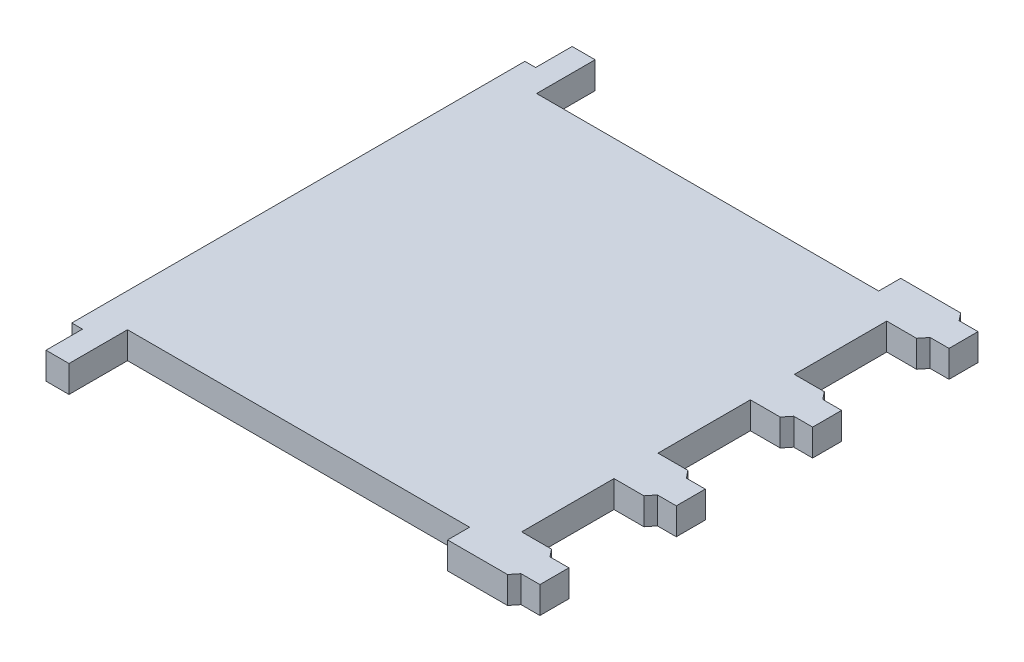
ISO-10303-21;
HEADER;
FILE_DESCRIPTION(('STEP AP214'),'2;1');
FILE_NAME('part.step','',(''),(''),'','','');
FILE_SCHEMA(('AUTOMOTIVE_DESIGN { 1 0 10303 214 1 1 1 1 }'));
ENDSEC;
DATA;
#1=APPLICATION_CONTEXT('core data for automotive mechanical design processes');
#2=APPLICATION_PROTOCOL_DEFINITION('international standard','automotive_design',2000,#1);
#3=PRODUCT_CONTEXT('',#1,'mechanical');
#4=PRODUCT('Part','Part','',(#3));
#5=PRODUCT_RELATED_PRODUCT_CATEGORY('part','',(#4));
#6=PRODUCT_DEFINITION_FORMATION('','',#4);
#7=PRODUCT_DEFINITION_CONTEXT('part definition',#1,'design');
#8=PRODUCT_DEFINITION('design','',#6,#7);
#9=PRODUCT_DEFINITION_SHAPE('','',#8);
#10=(LENGTH_UNIT() NAMED_UNIT(*) SI_UNIT(.MILLI.,.METRE.));
#11=(NAMED_UNIT(*) PLANE_ANGLE_UNIT() SI_UNIT($,.RADIAN.));
#12=(NAMED_UNIT(*) SI_UNIT($,.STERADIAN.) SOLID_ANGLE_UNIT());
#13=UNCERTAINTY_MEASURE_WITH_UNIT(LENGTH_MEASURE(1.E-05),#10,'distance_accuracy_value','');
#14=(GEOMETRIC_REPRESENTATION_CONTEXT(3) GLOBAL_UNCERTAINTY_ASSIGNED_CONTEXT((#13)) GLOBAL_UNIT_ASSIGNED_CONTEXT((#10,
#11,#12)) REPRESENTATION_CONTEXT('',''));
#15=CARTESIAN_POINT('',(0.,0.,0.));
#16=DIRECTION('',(0.,0.,1.));
#17=DIRECTION('',(1.,0.,0.));
#18=AXIS2_PLACEMENT_3D('',#15,#16,#17);
#19=CARTESIAN_POINT('',(3.13,0.,-1.77));
#20=DIRECTION('',(1.,0.,0.));
#21=DIRECTION('',(0.,0.,-1.));
#22=AXIS2_PLACEMENT_3D('',#19,#20,#21);
#23=PLANE('',#22);
#24=DIRECTION('',(0.,1.,0.));
#25=VECTOR('',#24,1.);
#26=CARTESIAN_POINT('',(3.13,0.,-2.04));
#27=LINE('',#26,#25);
#28=CARTESIAN_POINT('',(3.13,0.,-2.04));
#29=VERTEX_POINT('',#28);
#30=CARTESIAN_POINT('',(3.13,0.25,-2.04));
#31=VERTEX_POINT('',#30);
#32=EDGE_CURVE('E11',#29,#31,#27,.T.);
#33=ORIENTED_EDGE('',*,*,#32,.T.);
#34=DIRECTION('',(0.,0.,-1.));
#35=VECTOR('',#34,1.);
#36=CARTESIAN_POINT('',(3.13,0.25,-1.77));
#37=LINE('',#36,#35);
#38=CARTESIAN_POINT('',(3.13,0.25,-1.77));
#39=VERTEX_POINT('',#38);
#40=EDGE_CURVE('E25',#39,#31,#37,.T.);
#41=ORIENTED_EDGE('',*,*,#40,.F.);
#42=DIRECTION('',(0.,1.,0.));
#43=VECTOR('',#42,1.);
#44=CARTESIAN_POINT('',(3.13,0.,-1.77));
#45=LINE('',#44,#43);
#46=CARTESIAN_POINT('',(3.13,0.,-1.77));
#47=VERTEX_POINT('',#46);
#48=EDGE_CURVE('E315',#47,#39,#45,.T.);
#49=ORIENTED_EDGE('',*,*,#48,.F.);
#50=DIRECTION('',(0.,0.,-1.));
#51=VECTOR('',#50,1.);
#52=CARTESIAN_POINT('',(3.13,0.,-1.77));
#53=LINE('',#52,#51);
#54=EDGE_CURVE('E774',#47,#29,#53,.T.);
#55=ORIENTED_EDGE('',*,*,#54,.T.);
#56=EDGE_LOOP('',(#33,#41,#49,#55));
#57=FACE_BOUND('',#56,.T.);
#58=ADVANCED_FACE('F17',(#57),#23,.T.);
#59=CARTESIAN_POINT('',(0.,0.,0.));
#60=DIRECTION('',(0.,1.,0.));
#61=DIRECTION('',(1.,0.,0.));
#62=AXIS2_PLACEMENT_3D('',#59,#60,#61);
#63=PLANE('',#62);
#64=DIRECTION('',(0.,0.,1.));
#65=VECTOR('',#64,1.);
#66=CARTESIAN_POINT('',(-1.06,0.,2.11));
#67=LINE('',#66,#65);
#68=CARTESIAN_POINT('',(-1.06,0.,2.11));
#69=VERTEX_POINT('',#68);
#70=CARTESIAN_POINT('',(-1.06,0.,2.45));
#71=VERTEX_POINT('',#70);
#72=EDGE_CURVE('E769',#69,#71,#67,.T.);
#73=ORIENTED_EDGE('',*,*,#72,.F.);
#74=DIRECTION('',(1.,0.,0.));
#75=VECTOR('',#74,1.);
#76=CARTESIAN_POINT('',(-1.16,0.,2.11));
#77=LINE('',#76,#75);
#78=CARTESIAN_POINT('',(-1.16,0.,2.11));
#79=VERTEX_POINT('',#78);
#80=EDGE_CURVE('E764',#79,#69,#77,.T.);
#81=ORIENTED_EDGE('',*,*,#80,.F.);
#82=DIRECTION('',(0.,0.,1.));
#83=VECTOR('',#82,1.);
#84=CARTESIAN_POINT('',(-1.16,0.,-2.11));
#85=LINE('',#84,#83);
#86=CARTESIAN_POINT('',(-1.16,0.,-2.11));
#87=VERTEX_POINT('',#86);
#88=EDGE_CURVE('E759',#87,#79,#85,.T.);
#89=ORIENTED_EDGE('',*,*,#88,.F.);
#90=DIRECTION('',(-1.,0.,0.));
#91=VECTOR('',#90,1.);
#92=CARTESIAN_POINT('',(-1.06,0.,-2.11));
#93=LINE('',#92,#91);
#94=CARTESIAN_POINT('',(-1.06,0.,-2.11));
#95=VERTEX_POINT('',#94);
#96=EDGE_CURVE('E754',#95,#87,#93,.T.);
#97=ORIENTED_EDGE('',*,*,#96,.F.);
#98=DIRECTION('',(0.,0.,1.));
#99=VECTOR('',#98,1.);
#100=CARTESIAN_POINT('',(-1.06,0.,-2.45));
#101=LINE('',#100,#99);
#102=CARTESIAN_POINT('',(-1.06,0.,-2.45));
#103=VERTEX_POINT('',#102);
#104=EDGE_CURVE('E749',#103,#95,#101,.T.);
#105=ORIENTED_EDGE('',*,*,#104,.F.);
#106=DIRECTION('',(-1.,0.,0.));
#107=VECTOR('',#106,1.);
#108=CARTESIAN_POINT('',(-0.845758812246,0.,-2.45));
#109=LINE('',#108,#107);
#110=CARTESIAN_POINT('',(-0.845758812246,0.,-2.45));
#111=VERTEX_POINT('',#110);
#112=EDGE_CURVE('E744',#111,#103,#109,.T.);
#113=ORIENTED_EDGE('',*,*,#112,.F.);
#114=DIRECTION('',(0.,0.,-1.));
#115=VECTOR('',#114,1.);
#116=CARTESIAN_POINT('',(-0.845758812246,0.,-1.905));
#117=LINE('',#116,#115);
#118=CARTESIAN_POINT('',(-0.845758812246,0.,-1.905));
#119=VERTEX_POINT('',#118);
#120=EDGE_CURVE('E739',#119,#111,#117,.T.);
#121=ORIENTED_EDGE('',*,*,#120,.F.);
#122=DIRECTION('',(-1.,0.,0.));
#123=VECTOR('',#122,1.);
#124=CARTESIAN_POINT('',(2.34,0.,-1.905));
#125=LINE('',#124,#123);
#126=CARTESIAN_POINT('',(2.34,0.,-1.905));
#127=VERTEX_POINT('',#126);
#128=EDGE_CURVE('E734',#127,#119,#125,.T.);
#129=ORIENTED_EDGE('',*,*,#128,.F.);
#130=DIRECTION('',(0.,0.,1.));
#131=VECTOR('',#130,1.);
#132=CARTESIAN_POINT('',(2.34,0.,-2.11));
#133=LINE('',#132,#131);
#134=CARTESIAN_POINT('',(2.34,0.,-2.11));
#135=VERTEX_POINT('',#134);
#136=EDGE_CURVE('E729',#135,#127,#133,.T.);
#137=ORIENTED_EDGE('',*,*,#136,.F.);
#138=DIRECTION('',(-1.,0.,0.));
#139=VECTOR('',#138,1.);
#140=CARTESIAN_POINT('',(2.89809535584,0.,-2.11));
#141=LINE('',#140,#139);
#142=CARTESIAN_POINT('',(2.89809535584,0.,-2.11));
#143=VERTEX_POINT('',#142);
#144=EDGE_CURVE('E724',#143,#135,#141,.T.);
#145=ORIENTED_EDGE('',*,*,#144,.F.);
#146=DIRECTION('',(-0.625007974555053,0.,-0.780618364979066));
#147=VECTOR('',#146,1.);
#148=CARTESIAN_POINT('',(2.954141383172,0.,-2.04));
#149=LINE('',#148,#147);
#150=CARTESIAN_POINT('',(2.954141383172,0.,-2.04));
#151=VERTEX_POINT('',#150);
#152=EDGE_CURVE('E719',#151,#143,#149,.T.);
#153=ORIENTED_EDGE('',*,*,#152,.F.);
#154=DIRECTION('',(-1.,0.,0.));
#155=VECTOR('',#154,1.);
#156=CARTESIAN_POINT('',(3.13,0.,-2.04));
#157=LINE('',#156,#155);
#158=EDGE_CURVE('E714',#29,#151,#157,.T.);
#159=ORIENTED_EDGE('',*,*,#158,.F.);
#160=ORIENTED_EDGE('',*,*,#54,.F.);
#161=DIRECTION('',(1.,0.,0.));
#162=VECTOR('',#161,1.);
#163=CARTESIAN_POINT('',(2.954141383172,0.,-1.77));
#164=LINE('',#163,#162);
#165=CARTESIAN_POINT('',(2.954141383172,0.,-1.77));
#166=VERTEX_POINT('',#165);
#167=EDGE_CURVE('E710',#166,#47,#164,.T.);
#168=ORIENTED_EDGE('',*,*,#167,.F.);
#169=DIRECTION('',(0.625007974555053,0.,-0.780618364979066));
#170=VECTOR('',#169,1.);
#171=CARTESIAN_POINT('',(2.89809535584,0.,-1.7));
#172=LINE('',#171,#170);
#173=CARTESIAN_POINT('',(2.89809535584,0.,-1.7));
#174=VERTEX_POINT('',#173);
#175=EDGE_CURVE('E309',#174,#166,#172,.T.);
#176=ORIENTED_EDGE('',*,*,#175,.F.);
#177=DIRECTION('',(1.,0.,0.));
#178=VECTOR('',#177,1.);
#179=CARTESIAN_POINT('',(2.62,0.,-1.7));
#180=LINE('',#179,#178);
#181=CARTESIAN_POINT('',(2.62,0.,-1.7));
#182=VERTEX_POINT('',#181);
#183=EDGE_CURVE('E702',#182,#174,#180,.T.);
#184=ORIENTED_EDGE('',*,*,#183,.F.);
#185=DIRECTION('',(0.,0.,-1.));
#186=VECTOR('',#185,1.);
#187=CARTESIAN_POINT('',(2.62,0.,-0.84));
#188=LINE('',#187,#186);
#189=CARTESIAN_POINT('',(2.62,0.,-0.84));
#190=VERTEX_POINT('',#189);
#191=EDGE_CURVE('E697',#190,#182,#188,.T.);
#192=ORIENTED_EDGE('',*,*,#191,.F.);
#193=DIRECTION('',(-1.,0.,0.));
#194=VECTOR('',#193,1.);
#195=CARTESIAN_POINT('',(2.89809535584,0.,-0.84));
#196=LINE('',#195,#194);
#197=CARTESIAN_POINT('',(2.89809535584,0.,-0.84));
#198=VERTEX_POINT('',#197);
#199=EDGE_CURVE('E692',#198,#190,#196,.T.);
#200=ORIENTED_EDGE('',*,*,#199,.F.);
#201=DIRECTION('',(-0.625007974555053,0.,-0.780618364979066));
#202=VECTOR('',#201,1.);
#203=CARTESIAN_POINT('',(2.954141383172,0.,-0.77));
#204=LINE('',#203,#202);
#205=CARTESIAN_POINT('',(2.954141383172,0.,-0.77));
#206=VERTEX_POINT('',#205);
#207=EDGE_CURVE('E687',#206,#198,#204,.T.);
#208=ORIENTED_EDGE('',*,*,#207,.F.);
#209=DIRECTION('',(-1.,0.,0.));
#210=VECTOR('',#209,1.);
#211=CARTESIAN_POINT('',(3.13,0.,-0.77));
#212=LINE('',#211,#210);
#213=CARTESIAN_POINT('',(3.13,0.,-0.77));
#214=VERTEX_POINT('',#213);
#215=EDGE_CURVE('E682',#214,#206,#212,.T.);
#216=ORIENTED_EDGE('',*,*,#215,.F.);
#217=DIRECTION('',(0.,0.,-1.));
#218=VECTOR('',#217,1.);
#219=CARTESIAN_POINT('',(3.13,0.,-0.5));
#220=LINE('',#219,#218);
#221=CARTESIAN_POINT('',(3.13,0.,-0.5));
#222=VERTEX_POINT('',#221);
#223=EDGE_CURVE('E677',#222,#214,#220,.T.);
#224=ORIENTED_EDGE('',*,*,#223,.F.);
#225=DIRECTION('',(1.,0.,0.));
#226=VECTOR('',#225,1.);
#227=CARTESIAN_POINT('',(2.954141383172,0.,-0.5));
#228=LINE('',#227,#226);
#229=CARTESIAN_POINT('',(2.954141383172,0.,-0.5));
#230=VERTEX_POINT('',#229);
#231=EDGE_CURVE('E672',#230,#222,#228,.T.);
#232=ORIENTED_EDGE('',*,*,#231,.F.);
#233=DIRECTION('',(0.625007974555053,0.,-0.780618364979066));
#234=VECTOR('',#233,1.);
#235=CARTESIAN_POINT('',(2.89809535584,0.,-0.43));
#236=LINE('',#235,#234);
#237=CARTESIAN_POINT('',(2.89809535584,0.,-0.43));
#238=VERTEX_POINT('',#237);
#239=EDGE_CURVE('E667',#238,#230,#236,.T.);
#240=ORIENTED_EDGE('',*,*,#239,.F.);
#241=DIRECTION('',(1.,0.,0.));
#242=VECTOR('',#241,1.);
#243=CARTESIAN_POINT('',(2.62,0.,-0.43));
#244=LINE('',#243,#242);
#245=CARTESIAN_POINT('',(2.62,0.,-0.43));
#246=VERTEX_POINT('',#245);
#247=EDGE_CURVE('E662',#246,#238,#244,.T.);
#248=ORIENTED_EDGE('',*,*,#247,.F.);
#249=DIRECTION('',(0.,0.,-1.));
#250=VECTOR('',#249,1.);
#251=CARTESIAN_POINT('',(2.62,0.,0.43));
#252=LINE('',#251,#250);
#253=CARTESIAN_POINT('',(2.62,0.,0.43));
#254=VERTEX_POINT('',#253);
#255=EDGE_CURVE('E657',#254,#246,#252,.T.);
#256=ORIENTED_EDGE('',*,*,#255,.F.);
#257=DIRECTION('',(-1.,0.,0.));
#258=VECTOR('',#257,1.);
#259=CARTESIAN_POINT('',(2.89809535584,0.,0.43));
#260=LINE('',#259,#258);
#261=CARTESIAN_POINT('',(2.89809535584,0.,0.43));
#262=VERTEX_POINT('',#261);
#263=EDGE_CURVE('E652',#262,#254,#260,.T.);
#264=ORIENTED_EDGE('',*,*,#263,.F.);
#265=DIRECTION('',(-0.625007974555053,0.,-0.780618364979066));
#266=VECTOR('',#265,1.);
#267=CARTESIAN_POINT('',(2.954141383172,0.,0.5));
#268=LINE('',#267,#266);
#269=CARTESIAN_POINT('',(2.954141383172,0.,0.5));
#270=VERTEX_POINT('',#269);
#271=EDGE_CURVE('E647',#270,#262,#268,.T.);
#272=ORIENTED_EDGE('',*,*,#271,.F.);
#273=DIRECTION('',(-1.,0.,0.));
#274=VECTOR('',#273,1.);
#275=CARTESIAN_POINT('',(3.13,0.,0.5));
#276=LINE('',#275,#274);
#277=CARTESIAN_POINT('',(3.13,0.,0.5));
#278=VERTEX_POINT('',#277);
#279=EDGE_CURVE('E642',#278,#270,#276,.T.);
#280=ORIENTED_EDGE('',*,*,#279,.F.);
#281=DIRECTION('',(0.,0.,-1.));
#282=VECTOR('',#281,1.);
#283=CARTESIAN_POINT('',(3.13,0.,0.77));
#284=LINE('',#283,#282);
#285=CARTESIAN_POINT('',(3.13,0.,0.77));
#286=VERTEX_POINT('',#285);
#287=EDGE_CURVE('E637',#286,#278,#284,.T.);
#288=ORIENTED_EDGE('',*,*,#287,.F.);
#289=DIRECTION('',(1.,0.,0.));
#290=VECTOR('',#289,1.);
#291=CARTESIAN_POINT('',(2.954141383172,0.,0.77));
#292=LINE('',#291,#290);
#293=CARTESIAN_POINT('',(2.954141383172,0.,0.77));
#294=VERTEX_POINT('',#293);
#295=EDGE_CURVE('E632',#294,#286,#292,.T.);
#296=ORIENTED_EDGE('',*,*,#295,.F.);
#297=DIRECTION('',(0.625007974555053,0.,-0.780618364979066));
#298=VECTOR('',#297,1.);
#299=CARTESIAN_POINT('',(2.89809535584,0.,0.84));
#300=LINE('',#299,#298);
#301=CARTESIAN_POINT('',(2.89809535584,0.,0.84));
#302=VERTEX_POINT('',#301);
#303=EDGE_CURVE('E627',#302,#294,#300,.T.);
#304=ORIENTED_EDGE('',*,*,#303,.F.);
#305=DIRECTION('',(1.,0.,0.));
#306=VECTOR('',#305,1.);
#307=CARTESIAN_POINT('',(2.62,0.,0.84));
#308=LINE('',#307,#306);
#309=CARTESIAN_POINT('',(2.62,0.,0.84));
#310=VERTEX_POINT('',#309);
#311=EDGE_CURVE('E622',#310,#302,#308,.T.);
#312=ORIENTED_EDGE('',*,*,#311,.F.);
#313=DIRECTION('',(0.,0.,-1.));
#314=VECTOR('',#313,1.);
#315=CARTESIAN_POINT('',(2.62,0.,1.7));
#316=LINE('',#315,#314);
#317=CARTESIAN_POINT('',(2.62,0.,1.7));
#318=VERTEX_POINT('',#317);
#319=EDGE_CURVE('E617',#318,#310,#316,.T.);
#320=ORIENTED_EDGE('',*,*,#319,.F.);
#321=DIRECTION('',(-1.,0.,0.));
#322=VECTOR('',#321,1.);
#323=CARTESIAN_POINT('',(2.89809535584,0.,1.7));
#324=LINE('',#323,#322);
#325=CARTESIAN_POINT('',(2.89809535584,0.,1.7));
#326=VERTEX_POINT('',#325);
#327=EDGE_CURVE('E612',#326,#318,#324,.T.);
#328=ORIENTED_EDGE('',*,*,#327,.F.);
#329=DIRECTION('',(-0.625007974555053,0.,-0.780618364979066));
#330=VECTOR('',#329,1.);
#331=CARTESIAN_POINT('',(2.954141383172,0.,1.77));
#332=LINE('',#331,#330);
#333=CARTESIAN_POINT('',(2.954141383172,0.,1.77));
#334=VERTEX_POINT('',#333);
#335=EDGE_CURVE('E607',#334,#326,#332,.T.);
#336=ORIENTED_EDGE('',*,*,#335,.F.);
#337=DIRECTION('',(-1.,0.,0.));
#338=VECTOR('',#337,1.);
#339=CARTESIAN_POINT('',(3.13,0.,1.77));
#340=LINE('',#339,#338);
#341=CARTESIAN_POINT('',(3.13,0.,1.77));
#342=VERTEX_POINT('',#341);
#343=EDGE_CURVE('E602',#342,#334,#340,.T.);
#344=ORIENTED_EDGE('',*,*,#343,.F.);
#345=DIRECTION('',(0.,0.,-1.));
#346=VECTOR('',#345,1.);
#347=CARTESIAN_POINT('',(3.13,0.,2.04));
#348=LINE('',#347,#346);
#349=CARTESIAN_POINT('',(3.13,0.,2.04));
#350=VERTEX_POINT('',#349);
#351=EDGE_CURVE('E597',#350,#342,#348,.T.);
#352=ORIENTED_EDGE('',*,*,#351,.F.);
#353=DIRECTION('',(1.,0.,0.));
#354=VECTOR('',#353,1.);
#355=CARTESIAN_POINT('',(2.954141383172,0.,2.04));
#356=LINE('',#355,#354);
#357=CARTESIAN_POINT('',(2.954141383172,0.,2.04));
#358=VERTEX_POINT('',#357);
#359=EDGE_CURVE('E592',#358,#350,#356,.T.);
#360=ORIENTED_EDGE('',*,*,#359,.F.);
#361=DIRECTION('',(0.625007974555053,0.,-0.780618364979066));
#362=VECTOR('',#361,1.);
#363=CARTESIAN_POINT('',(2.89809535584,0.,2.11));
#364=LINE('',#363,#362);
#365=CARTESIAN_POINT('',(2.89809535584,0.,2.11));
#366=VERTEX_POINT('',#365);
#367=EDGE_CURVE('E587',#366,#358,#364,.T.);
#368=ORIENTED_EDGE('',*,*,#367,.F.);
#369=DIRECTION('',(1.,0.,0.));
#370=VECTOR('',#369,1.);
#371=CARTESIAN_POINT('',(2.34,0.,2.11));
#372=LINE('',#371,#370);
#373=CARTESIAN_POINT('',(2.34,0.,2.11));
#374=VERTEX_POINT('',#373);
#375=EDGE_CURVE('E582',#374,#366,#372,.T.);
#376=ORIENTED_EDGE('',*,*,#375,.F.);
#377=DIRECTION('',(0.,0.,1.));
#378=VECTOR('',#377,1.);
#379=CARTESIAN_POINT('',(2.34,0.,1.905));
#380=LINE('',#379,#378);
#381=CARTESIAN_POINT('',(2.34,0.,1.905));
#382=VERTEX_POINT('',#381);
#383=EDGE_CURVE('E577',#382,#374,#380,.T.);
#384=ORIENTED_EDGE('',*,*,#383,.F.);
#385=DIRECTION('',(1.,0.,0.));
#386=VECTOR('',#385,1.);
#387=CARTESIAN_POINT('',(-0.845758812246,0.,1.905));
#388=LINE('',#387,#386);
#389=CARTESIAN_POINT('',(-0.845758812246,0.,1.905));
#390=VERTEX_POINT('',#389);
#391=EDGE_CURVE('E572',#390,#382,#388,.T.);
#392=ORIENTED_EDGE('',*,*,#391,.F.);
#393=DIRECTION('',(0.,0.,-1.));
#394=VECTOR('',#393,1.);
#395=CARTESIAN_POINT('',(-0.845758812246,0.,2.45));
#396=LINE('',#395,#394);
#397=CARTESIAN_POINT('',(-0.845758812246,0.,2.45));
#398=VERTEX_POINT('',#397);
#399=EDGE_CURVE('E567',#398,#390,#396,.T.);
#400=ORIENTED_EDGE('',*,*,#399,.F.);
#401=DIRECTION('',(1.,0.,0.));
#402=VECTOR('',#401,1.);
#403=CARTESIAN_POINT('',(-1.06,0.,2.45));
#404=LINE('',#403,#402);
#405=EDGE_CURVE('E562',#71,#398,#404,.T.);
#406=ORIENTED_EDGE('',*,*,#405,.F.);
#407=EDGE_LOOP('',(#73,#81,#89,#97,#105,#113,#121,#129,#137,#145,#153,#159,#160,#168,#176,#184,
#192,#200,#208,#216,#224,#232,#240,#248,#256,#264,#272,#280,#288,#296,#304,#312,#320,#328,#336,
#344,#352,#360,#368,#376,#384,#392,#400,#406));
#408=FACE_BOUND('',#407,.T.);
#409=ADVANCED_FACE('F973',(#408),#63,.F.);
#410=CARTESIAN_POINT('',(-1.06,0.,2.45));
#411=DIRECTION('',(0.,0.,1.));
#412=DIRECTION('',(1.,0.,0.));
#413=AXIS2_PLACEMENT_3D('',#410,#411,#412);
#414=PLANE('',#413);
#415=DIRECTION('',(0.,1.,0.));
#416=VECTOR('',#415,1.);
#417=CARTESIAN_POINT('',(-0.845758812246,0.,2.45));
#418=LINE('',#417,#416);
#419=CARTESIAN_POINT('',(-0.845758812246,0.25,2.45));
#420=VERTEX_POINT('',#419);
#421=EDGE_CURVE('E558',#398,#420,#418,.T.);
#422=ORIENTED_EDGE('',*,*,#421,.T.);
#423=DIRECTION('',(1.,0.,0.));
#424=VECTOR('',#423,1.);
#425=CARTESIAN_POINT('',(-1.06,0.25,2.45));
#426=LINE('',#425,#424);
#427=CARTESIAN_POINT('',(-1.06,0.25,2.45));
#428=VERTEX_POINT('',#427);
#429=EDGE_CURVE('E553',#428,#420,#426,.T.);
#430=ORIENTED_EDGE('',*,*,#429,.F.);
#431=DIRECTION('',(0.,1.,0.));
#432=VECTOR('',#431,1.);
#433=CARTESIAN_POINT('',(-1.06,0.,2.45));
#434=LINE('',#433,#432);
#435=EDGE_CURVE('E548',#71,#428,#434,.T.);
#436=ORIENTED_EDGE('',*,*,#435,.F.);
#437=ORIENTED_EDGE('',*,*,#405,.T.);
#438=EDGE_LOOP('',(#422,#430,#436,#437));
#439=FACE_BOUND('',#438,.T.);
#440=ADVANCED_FACE('F825',(#439),#414,.T.);
#441=CARTESIAN_POINT('',(-1.06,0.,2.11));
#442=DIRECTION('',(-1.,0.,0.));
#443=DIRECTION('',(0.,0.,1.));
#444=AXIS2_PLACEMENT_3D('',#441,#442,#443);
#445=PLANE('',#444);
#446=ORIENTED_EDGE('',*,*,#435,.T.);
#447=DIRECTION('',(0.,0.,1.));
#448=VECTOR('',#447,1.);
#449=CARTESIAN_POINT('',(-1.06,0.25,2.11));
#450=LINE('',#449,#448);
#451=CARTESIAN_POINT('',(-1.06,0.25,2.11));
#452=VERTEX_POINT('',#451);
#453=EDGE_CURVE('E543',#452,#428,#450,.T.);
#454=ORIENTED_EDGE('',*,*,#453,.F.);
#455=DIRECTION('',(0.,1.,0.));
#456=VECTOR('',#455,1.);
#457=CARTESIAN_POINT('',(-1.06,0.,2.11));
#458=LINE('',#457,#456);
#459=EDGE_CURVE('E538',#69,#452,#458,.T.);
#460=ORIENTED_EDGE('',*,*,#459,.F.);
#461=ORIENTED_EDGE('',*,*,#72,.T.);
#462=EDGE_LOOP('',(#446,#454,#460,#461));
#463=FACE_BOUND('',#462,.T.);
#464=ADVANCED_FACE('F820',(#463),#445,.T.);
#465=CARTESIAN_POINT('',(-1.16,0.,2.11));
#466=DIRECTION('',(0.,0.,1.));
#467=DIRECTION('',(1.,0.,0.));
#468=AXIS2_PLACEMENT_3D('',#465,#466,#467);
#469=PLANE('',#468);
#470=ORIENTED_EDGE('',*,*,#459,.T.);
#471=DIRECTION('',(1.,0.,0.));
#472=VECTOR('',#471,1.);
#473=CARTESIAN_POINT('',(-1.16,0.25,2.11));
#474=LINE('',#473,#472);
#475=CARTESIAN_POINT('',(-1.16,0.25,2.11));
#476=VERTEX_POINT('',#475);
#477=EDGE_CURVE('E533',#476,#452,#474,.T.);
#478=ORIENTED_EDGE('',*,*,#477,.F.);
#479=DIRECTION('',(0.,1.,0.));
#480=VECTOR('',#479,1.);
#481=CARTESIAN_POINT('',(-1.16,0.,2.11));
#482=LINE('',#481,#480);
#483=EDGE_CURVE('E528',#79,#476,#482,.T.);
#484=ORIENTED_EDGE('',*,*,#483,.F.);
#485=ORIENTED_EDGE('',*,*,#80,.T.);
#486=EDGE_LOOP('',(#470,#478,#484,#485));
#487=FACE_BOUND('',#486,.T.);
#488=ADVANCED_FACE('F817',(#487),#469,.T.);
#489=CARTESIAN_POINT('',(-1.16,0.,-2.11));
#490=DIRECTION('',(-1.,0.,0.));
#491=DIRECTION('',(0.,0.,1.));
#492=AXIS2_PLACEMENT_3D('',#489,#490,#491);
#493=PLANE('',#492);
#494=ORIENTED_EDGE('',*,*,#483,.T.);
#495=DIRECTION('',(0.,0.,1.));
#496=VECTOR('',#495,1.);
#497=CARTESIAN_POINT('',(-1.16,0.25,-2.11));
#498=LINE('',#497,#496);
#499=CARTESIAN_POINT('',(-1.16,0.25,-2.11));
#500=VERTEX_POINT('',#499);
#501=EDGE_CURVE('E523',#500,#476,#498,.T.);
#502=ORIENTED_EDGE('',*,*,#501,.F.);
#503=DIRECTION('',(0.,1.,0.));
#504=VECTOR('',#503,1.);
#505=CARTESIAN_POINT('',(-1.16,0.,-2.11));
#506=LINE('',#505,#504);
#507=EDGE_CURVE('E518',#87,#500,#506,.T.);
#508=ORIENTED_EDGE('',*,*,#507,.F.);
#509=ORIENTED_EDGE('',*,*,#88,.T.);
#510=EDGE_LOOP('',(#494,#502,#508,#509));
#511=FACE_BOUND('',#510,.T.);
#512=ADVANCED_FACE('F815',(#511),#493,.T.);
#513=CARTESIAN_POINT('',(-1.06,0.,-2.11));
#514=DIRECTION('',(0.,0.,-1.));
#515=DIRECTION('',(-1.,0.,0.));
#516=AXIS2_PLACEMENT_3D('',#513,#514,#515);
#517=PLANE('',#516);
#518=ORIENTED_EDGE('',*,*,#507,.T.);
#519=DIRECTION('',(-1.,0.,0.));
#520=VECTOR('',#519,1.);
#521=CARTESIAN_POINT('',(-1.06,0.25,-2.11));
#522=LINE('',#521,#520);
#523=CARTESIAN_POINT('',(-1.06,0.25,-2.11));
#524=VERTEX_POINT('',#523);
#525=EDGE_CURVE('E513',#524,#500,#522,.T.);
#526=ORIENTED_EDGE('',*,*,#525,.F.);
#527=DIRECTION('',(0.,1.,0.));
#528=VECTOR('',#527,1.);
#529=CARTESIAN_POINT('',(-1.06,0.,-2.11));
#530=LINE('',#529,#528);
#531=EDGE_CURVE('E508',#95,#524,#530,.T.);
#532=ORIENTED_EDGE('',*,*,#531,.F.);
#533=ORIENTED_EDGE('',*,*,#96,.T.);
#534=EDGE_LOOP('',(#518,#526,#532,#533));
#535=FACE_BOUND('',#534,.T.);
#536=ADVANCED_FACE('F811',(#535),#517,.T.);
#537=CARTESIAN_POINT('',(-1.06,0.,-2.45));
#538=DIRECTION('',(-1.,0.,0.));
#539=DIRECTION('',(0.,0.,1.));
#540=AXIS2_PLACEMENT_3D('',#537,#538,#539);
#541=PLANE('',#540);
#542=ORIENTED_EDGE('',*,*,#531,.T.);
#543=DIRECTION('',(0.,0.,1.));
#544=VECTOR('',#543,1.);
#545=CARTESIAN_POINT('',(-1.06,0.25,-2.45));
#546=LINE('',#545,#544);
#547=CARTESIAN_POINT('',(-1.06,0.25,-2.45));
#548=VERTEX_POINT('',#547);
#549=EDGE_CURVE('E503',#548,#524,#546,.T.);
#550=ORIENTED_EDGE('',*,*,#549,.F.);
#551=DIRECTION('',(0.,1.,0.));
#552=VECTOR('',#551,1.);
#553=CARTESIAN_POINT('',(-1.06,0.,-2.45));
#554=LINE('',#553,#552);
#555=EDGE_CURVE('E498',#103,#548,#554,.T.);
#556=ORIENTED_EDGE('',*,*,#555,.F.);
#557=ORIENTED_EDGE('',*,*,#104,.T.);
#558=EDGE_LOOP('',(#542,#550,#556,#557));
#559=FACE_BOUND('',#558,.T.);
#560=ADVANCED_FACE('F808',(#559),#541,.T.);
#561=CARTESIAN_POINT('',(-0.845758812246,0.,-2.45));
#562=DIRECTION('',(0.,0.,-1.));
#563=DIRECTION('',(-1.,0.,0.));
#564=AXIS2_PLACEMENT_3D('',#561,#562,#563);
#565=PLANE('',#564);
#566=ORIENTED_EDGE('',*,*,#555,.T.);
#567=DIRECTION('',(-1.,0.,0.));
#568=VECTOR('',#567,1.);
#569=CARTESIAN_POINT('',(-0.845758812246,0.25,-2.45));
#570=LINE('',#569,#568);
#571=CARTESIAN_POINT('',(-0.845758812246,0.25,-2.45));
#572=VERTEX_POINT('',#571);
#573=EDGE_CURVE('E493',#572,#548,#570,.T.);
#574=ORIENTED_EDGE('',*,*,#573,.F.);
#575=DIRECTION('',(0.,1.,0.));
#576=VECTOR('',#575,1.);
#577=CARTESIAN_POINT('',(-0.845758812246,0.,-2.45));
#578=LINE('',#577,#576);
#579=EDGE_CURVE('E488',#111,#572,#578,.T.);
#580=ORIENTED_EDGE('',*,*,#579,.F.);
#581=ORIENTED_EDGE('',*,*,#112,.T.);
#582=EDGE_LOOP('',(#566,#574,#580,#581));
#583=FACE_BOUND('',#582,.T.);
#584=ADVANCED_FACE('F806',(#583),#565,.T.);
#585=CARTESIAN_POINT('',(-0.845758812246,0.,-1.905));
#586=DIRECTION('',(1.,0.,0.));
#587=DIRECTION('',(0.,0.,-1.));
#588=AXIS2_PLACEMENT_3D('',#585,#586,#587);
#589=PLANE('',#588);
#590=ORIENTED_EDGE('',*,*,#579,.T.);
#591=DIRECTION('',(0.,0.,-1.));
#592=VECTOR('',#591,1.);
#593=CARTESIAN_POINT('',(-0.845758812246,0.25,-1.905));
#594=LINE('',#593,#592);
#595=CARTESIAN_POINT('',(-0.845758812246,0.25,-1.905));
#596=VERTEX_POINT('',#595);
#597=EDGE_CURVE('E483',#596,#572,#594,.T.);
#598=ORIENTED_EDGE('',*,*,#597,.F.);
#599=DIRECTION('',(0.,1.,0.));
#600=VECTOR('',#599,1.);
#601=CARTESIAN_POINT('',(-0.845758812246,0.,-1.905));
#602=LINE('',#601,#600);
#603=EDGE_CURVE('E478',#119,#596,#602,.T.);
#604=ORIENTED_EDGE('',*,*,#603,.F.);
#605=ORIENTED_EDGE('',*,*,#120,.T.);
#606=EDGE_LOOP('',(#590,#598,#604,#605));
#607=FACE_BOUND('',#606,.T.);
#608=ADVANCED_FACE('F802',(#607),#589,.T.);
#609=CARTESIAN_POINT('',(2.34,0.,-1.905));
#610=DIRECTION('',(0.,0.,-1.));
#611=DIRECTION('',(-1.,0.,0.));
#612=AXIS2_PLACEMENT_3D('',#609,#610,#611);
#613=PLANE('',#612);
#614=ORIENTED_EDGE('',*,*,#603,.T.);
#615=DIRECTION('',(-1.,0.,0.));
#616=VECTOR('',#615,1.);
#617=CARTESIAN_POINT('',(2.34,0.25,-1.905));
#618=LINE('',#617,#616);
#619=CARTESIAN_POINT('',(2.34,0.25,-1.905));
#620=VERTEX_POINT('',#619);
#621=EDGE_CURVE('E473',#620,#596,#618,.T.);
#622=ORIENTED_EDGE('',*,*,#621,.F.);
#623=DIRECTION('',(0.,1.,0.));
#624=VECTOR('',#623,1.);
#625=CARTESIAN_POINT('',(2.34,0.,-1.905));
#626=LINE('',#625,#624);
#627=EDGE_CURVE('E468',#127,#620,#626,.T.);
#628=ORIENTED_EDGE('',*,*,#627,.F.);
#629=ORIENTED_EDGE('',*,*,#128,.T.);
#630=EDGE_LOOP('',(#614,#622,#628,#629));
#631=FACE_BOUND('',#630,.T.);
#632=ADVANCED_FACE('F799',(#631),#613,.T.);
#633=CARTESIAN_POINT('',(2.34,0.,-2.11));
#634=DIRECTION('',(-1.,0.,0.));
#635=DIRECTION('',(0.,0.,1.));
#636=AXIS2_PLACEMENT_3D('',#633,#634,#635);
#637=PLANE('',#636);
#638=ORIENTED_EDGE('',*,*,#627,.T.);
#639=DIRECTION('',(0.,0.,1.));
#640=VECTOR('',#639,1.);
#641=CARTESIAN_POINT('',(2.34,0.25,-2.11));
#642=LINE('',#641,#640);
#643=CARTESIAN_POINT('',(2.34,0.25,-2.11));
#644=VERTEX_POINT('',#643);
#645=EDGE_CURVE('E463',#644,#620,#642,.T.);
#646=ORIENTED_EDGE('',*,*,#645,.F.);
#647=DIRECTION('',(0.,1.,0.));
#648=VECTOR('',#647,1.);
#649=CARTESIAN_POINT('',(2.34,0.,-2.11));
#650=LINE('',#649,#648);
#651=EDGE_CURVE('E458',#135,#644,#650,.T.);
#652=ORIENTED_EDGE('',*,*,#651,.F.);
#653=ORIENTED_EDGE('',*,*,#136,.T.);
#654=EDGE_LOOP('',(#638,#646,#652,#653));
#655=FACE_BOUND('',#654,.T.);
#656=ADVANCED_FACE('F796',(#655),#637,.T.);
#657=CARTESIAN_POINT('',(2.89809535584,0.,-2.11));
#658=DIRECTION('',(0.,0.,-1.));
#659=DIRECTION('',(-1.,0.,0.));
#660=AXIS2_PLACEMENT_3D('',#657,#658,#659);
#661=PLANE('',#660);
#662=ORIENTED_EDGE('',*,*,#651,.T.);
#663=DIRECTION('',(-1.,0.,0.));
#664=VECTOR('',#663,1.);
#665=CARTESIAN_POINT('',(2.89809535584,0.25,-2.11));
#666=LINE('',#665,#664);
#667=CARTESIAN_POINT('',(2.89809535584,0.25,-2.11));
#668=VERTEX_POINT('',#667);
#669=EDGE_CURVE('E453',#668,#644,#666,.T.);
#670=ORIENTED_EDGE('',*,*,#669,.F.);
#671=DIRECTION('',(0.,1.,0.));
#672=VECTOR('',#671,1.);
#673=CARTESIAN_POINT('',(2.89809535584,0.,-2.11));
#674=LINE('',#673,#672);
#675=EDGE_CURVE('E448',#143,#668,#674,.T.);
#676=ORIENTED_EDGE('',*,*,#675,.F.);
#677=ORIENTED_EDGE('',*,*,#144,.T.);
#678=EDGE_LOOP('',(#662,#670,#676,#677));
#679=FACE_BOUND('',#678,.T.);
#680=ADVANCED_FACE('F793',(#679),#661,.T.);
#681=CARTESIAN_POINT('',(2.954141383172,0.,-2.04));
#682=DIRECTION('',(0.780618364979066,0.,-0.625007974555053));
#683=DIRECTION('',(-0.625007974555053,0.,-0.780618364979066));
#684=AXIS2_PLACEMENT_3D('',#681,#682,#683);
#685=PLANE('',#684);
#686=ORIENTED_EDGE('',*,*,#675,.T.);
#687=DIRECTION('',(-0.625007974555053,0.,-0.780618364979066));
#688=VECTOR('',#687,1.);
#689=CARTESIAN_POINT('',(2.954141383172,0.25,-2.04));
#690=LINE('',#689,#688);
#691=CARTESIAN_POINT('',(2.954141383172,0.25,-2.04));
#692=VERTEX_POINT('',#691);
#693=EDGE_CURVE('E443',#692,#668,#690,.T.);
#694=ORIENTED_EDGE('',*,*,#693,.F.);
#695=DIRECTION('',(0.,1.,0.));
#696=VECTOR('',#695,1.);
#697=CARTESIAN_POINT('',(2.954141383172,0.,-2.04));
#698=LINE('',#697,#696);
#699=EDGE_CURVE('E438',#151,#692,#698,.T.);
#700=ORIENTED_EDGE('',*,*,#699,.F.);
#701=ORIENTED_EDGE('',*,*,#152,.T.);
#702=EDGE_LOOP('',(#686,#694,#700,#701));
#703=FACE_BOUND('',#702,.T.);
#704=ADVANCED_FACE('F790',(#703),#685,.T.);
#705=CARTESIAN_POINT('',(3.13,0.,-2.04));
#706=DIRECTION('',(0.,0.,-1.));
#707=DIRECTION('',(-1.,0.,0.));
#708=AXIS2_PLACEMENT_3D('',#705,#706,#707);
#709=PLANE('',#708);
#710=ORIENTED_EDGE('',*,*,#699,.T.);
#711=DIRECTION('',(-1.,0.,0.));
#712=VECTOR('',#711,1.);
#713=CARTESIAN_POINT('',(3.13,0.25,-2.04));
#714=LINE('',#713,#712);
#715=EDGE_CURVE('E433',#31,#692,#714,.T.);
#716=ORIENTED_EDGE('',*,*,#715,.F.);
#717=ORIENTED_EDGE('',*,*,#32,.F.);
#718=ORIENTED_EDGE('',*,*,#158,.T.);
#719=EDGE_LOOP('',(#710,#716,#717,#718));
#720=FACE_BOUND('',#719,.T.);
#721=ADVANCED_FACE('F787',(#720),#709,.T.);
#722=CARTESIAN_POINT('',(0.,0.25,0.));
#723=DIRECTION('',(0.,1.,0.));
#724=DIRECTION('',(1.,0.,0.));
#725=AXIS2_PLACEMENT_3D('',#722,#723,#724);
#726=PLANE('',#725);
#727=DIRECTION('',(0.,0.,-1.));
#728=VECTOR('',#727,1.);
#729=CARTESIAN_POINT('',(-0.845758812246,0.25,2.45));
#730=LINE('',#729,#728);
#731=CARTESIAN_POINT('',(-0.845758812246,0.25,1.905));
#732=VERTEX_POINT('',#731);
#733=EDGE_CURVE('E429',#420,#732,#730,.T.);
#734=ORIENTED_EDGE('',*,*,#733,.T.);
#735=DIRECTION('',(1.,0.,0.));
#736=VECTOR('',#735,1.);
#737=CARTESIAN_POINT('',(-0.845758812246,0.25,1.905));
#738=LINE('',#737,#736);
#739=CARTESIAN_POINT('',(2.34,0.25,1.905));
#740=VERTEX_POINT('',#739);
#741=EDGE_CURVE('E425',#732,#740,#738,.T.);
#742=ORIENTED_EDGE('',*,*,#741,.T.);
#743=DIRECTION('',(0.,0.,1.));
#744=VECTOR('',#743,1.);
#745=CARTESIAN_POINT('',(2.34,0.25,1.905));
#746=LINE('',#745,#744);
#747=CARTESIAN_POINT('',(2.34,0.25,2.11));
#748=VERTEX_POINT('',#747);
#749=EDGE_CURVE('E421',#740,#748,#746,.T.);
#750=ORIENTED_EDGE('',*,*,#749,.T.);
#751=DIRECTION('',(1.,0.,0.));
#752=VECTOR('',#751,1.);
#753=CARTESIAN_POINT('',(2.34,0.25,2.11));
#754=LINE('',#753,#752);
#755=CARTESIAN_POINT('',(2.89809535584,0.25,2.11));
#756=VERTEX_POINT('',#755);
#757=EDGE_CURVE('E417',#748,#756,#754,.T.);
#758=ORIENTED_EDGE('',*,*,#757,.T.);
#759=DIRECTION('',(0.625007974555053,0.,-0.780618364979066));
#760=VECTOR('',#759,1.);
#761=CARTESIAN_POINT('',(2.89809535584,0.25,2.11));
#762=LINE('',#761,#760);
#763=CARTESIAN_POINT('',(2.954141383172,0.25,2.04));
#764=VERTEX_POINT('',#763);
#765=EDGE_CURVE('E413',#756,#764,#762,.T.);
#766=ORIENTED_EDGE('',*,*,#765,.T.);
#767=DIRECTION('',(1.,0.,0.));
#768=VECTOR('',#767,1.);
#769=CARTESIAN_POINT('',(2.954141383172,0.25,2.04));
#770=LINE('',#769,#768);
#771=CARTESIAN_POINT('',(3.13,0.25,2.04));
#772=VERTEX_POINT('',#771);
#773=EDGE_CURVE('E409',#764,#772,#770,.T.);
#774=ORIENTED_EDGE('',*,*,#773,.T.);
#775=DIRECTION('',(0.,0.,-1.));
#776=VECTOR('',#775,1.);
#777=CARTESIAN_POINT('',(3.13,0.25,2.04));
#778=LINE('',#777,#776);
#779=CARTESIAN_POINT('',(3.13,0.25,1.77));
#780=VERTEX_POINT('',#779);
#781=EDGE_CURVE('E405',#772,#780,#778,.T.);
#782=ORIENTED_EDGE('',*,*,#781,.T.);
#783=DIRECTION('',(-1.,0.,0.));
#784=VECTOR('',#783,1.);
#785=CARTESIAN_POINT('',(3.13,0.25,1.77));
#786=LINE('',#785,#784);
#787=CARTESIAN_POINT('',(2.954141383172,0.25,1.77));
#788=VERTEX_POINT('',#787);
#789=EDGE_CURVE('E401',#780,#788,#786,.T.);
#790=ORIENTED_EDGE('',*,*,#789,.T.);
#791=DIRECTION('',(-0.625007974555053,0.,-0.780618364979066));
#792=VECTOR('',#791,1.);
#793=CARTESIAN_POINT('',(2.954141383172,0.25,1.77));
#794=LINE('',#793,#792);
#795=CARTESIAN_POINT('',(2.89809535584,0.25,1.7));
#796=VERTEX_POINT('',#795);
#797=EDGE_CURVE('E397',#788,#796,#794,.T.);
#798=ORIENTED_EDGE('',*,*,#797,.T.);
#799=DIRECTION('',(-1.,0.,0.));
#800=VECTOR('',#799,1.);
#801=CARTESIAN_POINT('',(2.89809535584,0.25,1.7));
#802=LINE('',#801,#800);
#803=CARTESIAN_POINT('',(2.62,0.25,1.7));
#804=VERTEX_POINT('',#803);
#805=EDGE_CURVE('E393',#796,#804,#802,.T.);
#806=ORIENTED_EDGE('',*,*,#805,.T.);
#807=DIRECTION('',(0.,0.,-1.));
#808=VECTOR('',#807,1.);
#809=CARTESIAN_POINT('',(2.62,0.25,1.7));
#810=LINE('',#809,#808);
#811=CARTESIAN_POINT('',(2.62,0.25,0.84));
#812=VERTEX_POINT('',#811);
#813=EDGE_CURVE('E389',#804,#812,#810,.T.);
#814=ORIENTED_EDGE('',*,*,#813,.T.);
#815=DIRECTION('',(1.,0.,0.));
#816=VECTOR('',#815,1.);
#817=CARTESIAN_POINT('',(2.62,0.25,0.84));
#818=LINE('',#817,#816);
#819=CARTESIAN_POINT('',(2.89809535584,0.25,0.84));
#820=VERTEX_POINT('',#819);
#821=EDGE_CURVE('E385',#812,#820,#818,.T.);
#822=ORIENTED_EDGE('',*,*,#821,.T.);
#823=DIRECTION('',(0.625007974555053,0.,-0.780618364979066));
#824=VECTOR('',#823,1.);
#825=CARTESIAN_POINT('',(2.89809535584,0.25,0.84));
#826=LINE('',#825,#824);
#827=CARTESIAN_POINT('',(2.954141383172,0.25,0.77));
#828=VERTEX_POINT('',#827);
#829=EDGE_CURVE('E381',#820,#828,#826,.T.);
#830=ORIENTED_EDGE('',*,*,#829,.T.);
#831=DIRECTION('',(1.,0.,0.));
#832=VECTOR('',#831,1.);
#833=CARTESIAN_POINT('',(2.954141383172,0.25,0.77));
#834=LINE('',#833,#832);
#835=CARTESIAN_POINT('',(3.13,0.25,0.77));
#836=VERTEX_POINT('',#835);
#837=EDGE_CURVE('E377',#828,#836,#834,.T.);
#838=ORIENTED_EDGE('',*,*,#837,.T.);
#839=DIRECTION('',(0.,0.,-1.));
#840=VECTOR('',#839,1.);
#841=CARTESIAN_POINT('',(3.13,0.25,0.77));
#842=LINE('',#841,#840);
#843=CARTESIAN_POINT('',(3.13,0.25,0.5));
#844=VERTEX_POINT('',#843);
#845=EDGE_CURVE('E373',#836,#844,#842,.T.);
#846=ORIENTED_EDGE('',*,*,#845,.T.);
#847=DIRECTION('',(-1.,0.,0.));
#848=VECTOR('',#847,1.);
#849=CARTESIAN_POINT('',(3.13,0.25,0.5));
#850=LINE('',#849,#848);
#851=CARTESIAN_POINT('',(2.954141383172,0.25,0.5));
#852=VERTEX_POINT('',#851);
#853=EDGE_CURVE('E369',#844,#852,#850,.T.);
#854=ORIENTED_EDGE('',*,*,#853,.T.);
#855=DIRECTION('',(-0.625007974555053,0.,-0.780618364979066));
#856=VECTOR('',#855,1.);
#857=CARTESIAN_POINT('',(2.954141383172,0.25,0.5));
#858=LINE('',#857,#856);
#859=CARTESIAN_POINT('',(2.89809535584,0.25,0.43));
#860=VERTEX_POINT('',#859);
#861=EDGE_CURVE('E365',#852,#860,#858,.T.);
#862=ORIENTED_EDGE('',*,*,#861,.T.);
#863=DIRECTION('',(-1.,0.,0.));
#864=VECTOR('',#863,1.);
#865=CARTESIAN_POINT('',(2.89809535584,0.25,0.43));
#866=LINE('',#865,#864);
#867=CARTESIAN_POINT('',(2.62,0.25,0.43));
#868=VERTEX_POINT('',#867);
#869=EDGE_CURVE('E361',#860,#868,#866,.T.);
#870=ORIENTED_EDGE('',*,*,#869,.T.);
#871=DIRECTION('',(0.,0.,-1.));
#872=VECTOR('',#871,1.);
#873=CARTESIAN_POINT('',(2.62,0.25,0.43));
#874=LINE('',#873,#872);
#875=CARTESIAN_POINT('',(2.62,0.25,-0.43));
#876=VERTEX_POINT('',#875);
#877=EDGE_CURVE('E357',#868,#876,#874,.T.);
#878=ORIENTED_EDGE('',*,*,#877,.T.);
#879=DIRECTION('',(1.,0.,0.));
#880=VECTOR('',#879,1.);
#881=CARTESIAN_POINT('',(2.62,0.25,-0.43));
#882=LINE('',#881,#880);
#883=CARTESIAN_POINT('',(2.89809535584,0.25,-0.43));
#884=VERTEX_POINT('',#883);
#885=EDGE_CURVE('E353',#876,#884,#882,.T.);
#886=ORIENTED_EDGE('',*,*,#885,.T.);
#887=DIRECTION('',(0.625007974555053,0.,-0.780618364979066));
#888=VECTOR('',#887,1.);
#889=CARTESIAN_POINT('',(2.89809535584,0.25,-0.43));
#890=LINE('',#889,#888);
#891=CARTESIAN_POINT('',(2.954141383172,0.25,-0.5));
#892=VERTEX_POINT('',#891);
#893=EDGE_CURVE('E349',#884,#892,#890,.T.);
#894=ORIENTED_EDGE('',*,*,#893,.T.);
#895=DIRECTION('',(1.,0.,0.));
#896=VECTOR('',#895,1.);
#897=CARTESIAN_POINT('',(2.954141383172,0.25,-0.5));
#898=LINE('',#897,#896);
#899=CARTESIAN_POINT('',(3.13,0.25,-0.5));
#900=VERTEX_POINT('',#899);
#901=EDGE_CURVE('E345',#892,#900,#898,.T.);
#902=ORIENTED_EDGE('',*,*,#901,.T.);
#903=DIRECTION('',(0.,0.,-1.));
#904=VECTOR('',#903,1.);
#905=CARTESIAN_POINT('',(3.13,0.25,-0.5));
#906=LINE('',#905,#904);
#907=CARTESIAN_POINT('',(3.13,0.25,-0.77));
#908=VERTEX_POINT('',#907);
#909=EDGE_CURVE('E341',#900,#908,#906,.T.);
#910=ORIENTED_EDGE('',*,*,#909,.T.);
#911=DIRECTION('',(-1.,0.,0.));
#912=VECTOR('',#911,1.);
#913=CARTESIAN_POINT('',(3.13,0.25,-0.77));
#914=LINE('',#913,#912);
#915=CARTESIAN_POINT('',(2.954141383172,0.25,-0.77));
#916=VERTEX_POINT('',#915);
#917=EDGE_CURVE('E337',#908,#916,#914,.T.);
#918=ORIENTED_EDGE('',*,*,#917,.T.);
#919=DIRECTION('',(-0.625007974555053,0.,-0.780618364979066));
#920=VECTOR('',#919,1.);
#921=CARTESIAN_POINT('',(2.954141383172,0.25,-0.77));
#922=LINE('',#921,#920);
#923=CARTESIAN_POINT('',(2.89809535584,0.25,-0.84));
#924=VERTEX_POINT('',#923);
#925=EDGE_CURVE('E333',#916,#924,#922,.T.);
#926=ORIENTED_EDGE('',*,*,#925,.T.);
#927=DIRECTION('',(-1.,0.,0.));
#928=VECTOR('',#927,1.);
#929=CARTESIAN_POINT('',(2.89809535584,0.25,-0.84));
#930=LINE('',#929,#928);
#931=CARTESIAN_POINT('',(2.62,0.25,-0.84));
#932=VERTEX_POINT('',#931);
#933=EDGE_CURVE('E329',#924,#932,#930,.T.);
#934=ORIENTED_EDGE('',*,*,#933,.T.);
#935=DIRECTION('',(0.,0.,-1.));
#936=VECTOR('',#935,1.);
#937=CARTESIAN_POINT('',(2.62,0.25,-0.84));
#938=LINE('',#937,#936);
#939=CARTESIAN_POINT('',(2.62,0.25,-1.7));
#940=VERTEX_POINT('',#939);
#941=EDGE_CURVE('E325',#932,#940,#938,.T.);
#942=ORIENTED_EDGE('',*,*,#941,.T.);
#943=DIRECTION('',(1.,0.,0.));
#944=VECTOR('',#943,1.);
#945=CARTESIAN_POINT('',(2.62,0.25,-1.7));
#946=LINE('',#945,#944);
#947=CARTESIAN_POINT('',(2.89809535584,0.25,-1.7));
#948=VERTEX_POINT('',#947);
#949=EDGE_CURVE('E300',#940,#948,#946,.T.);
#950=ORIENTED_EDGE('',*,*,#949,.T.);
#951=DIRECTION('',(0.625007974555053,0.,-0.780618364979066));
#952=VECTOR('',#951,1.);
#953=CARTESIAN_POINT('',(2.89809535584,0.25,-1.7));
#954=LINE('',#953,#952);
#955=CARTESIAN_POINT('',(2.954141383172,0.25,-1.77));
#956=VERTEX_POINT('',#955);
#957=EDGE_CURVE('E293',#948,#956,#954,.T.);
#958=ORIENTED_EDGE('',*,*,#957,.T.);
#959=DIRECTION('',(1.,0.,0.));
#960=VECTOR('',#959,1.);
#961=CARTESIAN_POINT('',(2.954141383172,0.25,-1.77));
#962=LINE('',#961,#960);
#963=EDGE_CURVE('E297',#956,#39,#962,.T.);
#964=ORIENTED_EDGE('',*,*,#963,.T.);
#965=ORIENTED_EDGE('',*,*,#40,.T.);
#966=ORIENTED_EDGE('',*,*,#715,.T.);
#967=ORIENTED_EDGE('',*,*,#693,.T.);
#968=ORIENTED_EDGE('',*,*,#669,.T.);
#969=ORIENTED_EDGE('',*,*,#645,.T.);
#970=ORIENTED_EDGE('',*,*,#621,.T.);
#971=ORIENTED_EDGE('',*,*,#597,.T.);
#972=ORIENTED_EDGE('',*,*,#573,.T.);
#973=ORIENTED_EDGE('',*,*,#549,.T.);
#974=ORIENTED_EDGE('',*,*,#525,.T.);
#975=ORIENTED_EDGE('',*,*,#501,.T.);
#976=ORIENTED_EDGE('',*,*,#477,.T.);
#977=ORIENTED_EDGE('',*,*,#453,.T.);
#978=ORIENTED_EDGE('',*,*,#429,.T.);
#979=EDGE_LOOP('',(#734,#742,#750,#758,#766,#774,#782,#790,#798,#806,#814,#822,#830,#838,#846,
#854,#862,#870,#878,#886,#894,#902,#910,#918,#926,#934,#942,#950,#958,#964,#965,#966,#967,#968,
#969,#970,#971,#972,#973,#974,#975,#976,#977,#978));
#980=FACE_BOUND('',#979,.T.);
#981=ADVANCED_FACE('F295',(#980),#726,.T.);
#982=CARTESIAN_POINT('',(2.954141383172,0.,-1.77));
#983=DIRECTION('',(0.,0.,1.));
#984=DIRECTION('',(1.,0.,0.));
#985=AXIS2_PLACEMENT_3D('',#982,#983,#984);
#986=PLANE('',#985);
#987=ORIENTED_EDGE('',*,*,#48,.T.);
#988=ORIENTED_EDGE('',*,*,#963,.F.);
#989=DIRECTION('',(0.,1.,0.));
#990=VECTOR('',#989,1.);
#991=CARTESIAN_POINT('',(2.954141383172,0.,-1.77));
#992=LINE('',#991,#990);
#993=EDGE_CURVE('E307',#166,#956,#992,.T.);
#994=ORIENTED_EDGE('',*,*,#993,.F.);
#995=ORIENTED_EDGE('',*,*,#167,.T.);
#996=EDGE_LOOP('',(#987,#988,#994,#995));
#997=FACE_BOUND('',#996,.T.);
#998=ADVANCED_FACE('F314',(#997),#986,.T.);
#999=CARTESIAN_POINT('',(2.89809535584,0.,-1.7));
#1000=DIRECTION('',(0.780618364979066,0.,0.625007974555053));
#1001=DIRECTION('',(0.625007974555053,0.,-0.780618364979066));
#1002=AXIS2_PLACEMENT_3D('',#999,#1000,#1001);
#1003=PLANE('',#1002);
#1004=ORIENTED_EDGE('',*,*,#993,.T.);
#1005=ORIENTED_EDGE('',*,*,#957,.F.);
#1006=DIRECTION('',(0.,1.,0.));
#1007=VECTOR('',#1006,1.);
#1008=CARTESIAN_POINT('',(2.89809535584,0.,-1.7));
#1009=LINE('',#1008,#1007);
#1010=EDGE_CURVE('E312',#174,#948,#1009,.T.);
#1011=ORIENTED_EDGE('',*,*,#1010,.F.);
#1012=ORIENTED_EDGE('',*,*,#175,.T.);
#1013=EDGE_LOOP('',(#1004,#1005,#1011,#1012));
#1014=FACE_BOUND('',#1013,.T.);
#1015=ADVANCED_FACE('F308',(#1014),#1003,.T.);
#1016=CARTESIAN_POINT('',(2.62,0.,-1.7));
#1017=DIRECTION('',(0.,0.,1.));
#1018=DIRECTION('',(1.,0.,0.));
#1019=AXIS2_PLACEMENT_3D('',#1016,#1017,#1018);
#1020=PLANE('',#1019);
#1021=ORIENTED_EDGE('',*,*,#1010,.T.);
#1022=ORIENTED_EDGE('',*,*,#949,.F.);
#1023=DIRECTION('',(0.,1.,0.));
#1024=VECTOR('',#1023,1.);
#1025=CARTESIAN_POINT('',(2.62,0.,-1.7));
#1026=LINE('',#1025,#1024);
#1027=EDGE_CURVE('E960',#182,#940,#1026,.T.);
#1028=ORIENTED_EDGE('',*,*,#1027,.F.);
#1029=ORIENTED_EDGE('',*,*,#183,.T.);
#1030=EDGE_LOOP('',(#1021,#1022,#1028,#1029));
#1031=FACE_BOUND('',#1030,.T.);
#1032=ADVANCED_FACE('F970',(#1031),#1020,.T.);
#1033=CARTESIAN_POINT('',(2.62,0.,-0.84));
#1034=DIRECTION('',(1.,0.,0.));
#1035=DIRECTION('',(0.,0.,-1.));
#1036=AXIS2_PLACEMENT_3D('',#1033,#1034,#1035);
#1037=PLANE('',#1036);
#1038=ORIENTED_EDGE('',*,*,#1027,.T.);
#1039=ORIENTED_EDGE('',*,*,#941,.F.);
#1040=DIRECTION('',(0.,1.,0.));
#1041=VECTOR('',#1040,1.);
#1042=CARTESIAN_POINT('',(2.62,0.,-0.84));
#1043=LINE('',#1042,#1041);
#1044=EDGE_CURVE('E955',#190,#932,#1043,.T.);
#1045=ORIENTED_EDGE('',*,*,#1044,.F.);
#1046=ORIENTED_EDGE('',*,*,#191,.T.);
#1047=EDGE_LOOP('',(#1038,#1039,#1045,#1046));
#1048=FACE_BOUND('',#1047,.T.);
#1049=ADVANCED_FACE('F1018',(#1048),#1037,.T.);
#1050=CARTESIAN_POINT('',(2.89809535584,0.,-0.84));
#1051=DIRECTION('',(0.,0.,-1.));
#1052=DIRECTION('',(-1.,0.,0.));
#1053=AXIS2_PLACEMENT_3D('',#1050,#1051,#1052);
#1054=PLANE('',#1053);
#1055=ORIENTED_EDGE('',*,*,#1044,.T.);
#1056=ORIENTED_EDGE('',*,*,#933,.F.);
#1057=DIRECTION('',(0.,1.,0.));
#1058=VECTOR('',#1057,1.);
#1059=CARTESIAN_POINT('',(2.89809535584,0.,-0.84));
#1060=LINE('',#1059,#1058);
#1061=EDGE_CURVE('E950',#198,#924,#1060,.T.);
#1062=ORIENTED_EDGE('',*,*,#1061,.F.);
#1063=ORIENTED_EDGE('',*,*,#199,.T.);
#1064=EDGE_LOOP('',(#1055,#1056,#1062,#1063));
#1065=FACE_BOUND('',#1064,.T.);
#1066=ADVANCED_FACE('F1021',(#1065),#1054,.T.);
#1067=CARTESIAN_POINT('',(2.954141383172,0.,-0.77));
#1068=DIRECTION('',(0.780618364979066,0.,-0.625007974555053));
#1069=DIRECTION('',(-0.625007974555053,0.,-0.780618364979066));
#1070=AXIS2_PLACEMENT_3D('',#1067,#1068,#1069);
#1071=PLANE('',#1070);
#1072=ORIENTED_EDGE('',*,*,#1061,.T.);
#1073=ORIENTED_EDGE('',*,*,#925,.F.);
#1074=DIRECTION('',(0.,1.,0.));
#1075=VECTOR('',#1074,1.);
#1076=CARTESIAN_POINT('',(2.954141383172,0.,-0.77));
#1077=LINE('',#1076,#1075);
#1078=EDGE_CURVE('E945',#206,#916,#1077,.T.);
#1079=ORIENTED_EDGE('',*,*,#1078,.F.);
#1080=ORIENTED_EDGE('',*,*,#207,.T.);
#1081=EDGE_LOOP('',(#1072,#1073,#1079,#1080));
#1082=FACE_BOUND('',#1081,.T.);
#1083=ADVANCED_FACE('F1025',(#1082),#1071,.T.);
#1084=CARTESIAN_POINT('',(3.13,0.,-0.77));
#1085=DIRECTION('',(0.,0.,-1.));
#1086=DIRECTION('',(-1.,0.,0.));
#1087=AXIS2_PLACEMENT_3D('',#1084,#1085,#1086);
#1088=PLANE('',#1087);
#1089=ORIENTED_EDGE('',*,*,#1078,.T.);
#1090=ORIENTED_EDGE('',*,*,#917,.F.);
#1091=DIRECTION('',(0.,1.,0.));
#1092=VECTOR('',#1091,1.);
#1093=CARTESIAN_POINT('',(3.13,0.,-0.77));
#1094=LINE('',#1093,#1092);
#1095=EDGE_CURVE('E940',#214,#908,#1094,.T.);
#1096=ORIENTED_EDGE('',*,*,#1095,.F.);
#1097=ORIENTED_EDGE('',*,*,#215,.T.);
#1098=EDGE_LOOP('',(#1089,#1090,#1096,#1097));
#1099=FACE_BOUND('',#1098,.T.);
#1100=ADVANCED_FACE('F1029',(#1099),#1088,.T.);
#1101=CARTESIAN_POINT('',(3.13,0.,-0.5));
#1102=DIRECTION('',(1.,0.,0.));
#1103=DIRECTION('',(0.,0.,-1.));
#1104=AXIS2_PLACEMENT_3D('',#1101,#1102,#1103);
#1105=PLANE('',#1104);
#1106=ORIENTED_EDGE('',*,*,#1095,.T.);
#1107=ORIENTED_EDGE('',*,*,#909,.F.);
#1108=DIRECTION('',(0.,1.,0.));
#1109=VECTOR('',#1108,1.);
#1110=CARTESIAN_POINT('',(3.13,0.,-0.5));
#1111=LINE('',#1110,#1109);
#1112=EDGE_CURVE('E935',#222,#900,#1111,.T.);
#1113=ORIENTED_EDGE('',*,*,#1112,.F.);
#1114=ORIENTED_EDGE('',*,*,#223,.T.);
#1115=EDGE_LOOP('',(#1106,#1107,#1113,#1114));
#1116=FACE_BOUND('',#1115,.T.);
#1117=ADVANCED_FACE('F1033',(#1116),#1105,.T.);
#1118=CARTESIAN_POINT('',(2.954141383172,0.,-0.5));
#1119=DIRECTION('',(0.,0.,1.));
#1120=DIRECTION('',(1.,0.,0.));
#1121=AXIS2_PLACEMENT_3D('',#1118,#1119,#1120);
#1122=PLANE('',#1121);
#1123=ORIENTED_EDGE('',*,*,#1112,.T.);
#1124=ORIENTED_EDGE('',*,*,#901,.F.);
#1125=DIRECTION('',(0.,1.,0.));
#1126=VECTOR('',#1125,1.);
#1127=CARTESIAN_POINT('',(2.954141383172,0.,-0.5));
#1128=LINE('',#1127,#1126);
#1129=EDGE_CURVE('E930',#230,#892,#1128,.T.);
#1130=ORIENTED_EDGE('',*,*,#1129,.F.);
#1131=ORIENTED_EDGE('',*,*,#231,.T.);
#1132=EDGE_LOOP('',(#1123,#1124,#1130,#1131));
#1133=FACE_BOUND('',#1132,.T.);
#1134=ADVANCED_FACE('F1037',(#1133),#1122,.T.);
#1135=CARTESIAN_POINT('',(2.89809535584,0.,-0.43));
#1136=DIRECTION('',(0.780618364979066,0.,0.625007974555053));
#1137=DIRECTION('',(0.625007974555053,0.,-0.780618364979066));
#1138=AXIS2_PLACEMENT_3D('',#1135,#1136,#1137);
#1139=PLANE('',#1138);
#1140=ORIENTED_EDGE('',*,*,#1129,.T.);
#1141=ORIENTED_EDGE('',*,*,#893,.F.);
#1142=DIRECTION('',(0.,1.,0.));
#1143=VECTOR('',#1142,1.);
#1144=CARTESIAN_POINT('',(2.89809535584,0.,-0.43));
#1145=LINE('',#1144,#1143);
#1146=EDGE_CURVE('E925',#238,#884,#1145,.T.);
#1147=ORIENTED_EDGE('',*,*,#1146,.F.);
#1148=ORIENTED_EDGE('',*,*,#239,.T.);
#1149=EDGE_LOOP('',(#1140,#1141,#1147,#1148));
#1150=FACE_BOUND('',#1149,.T.);
#1151=ADVANCED_FACE('F1041',(#1150),#1139,.T.);
#1152=CARTESIAN_POINT('',(2.62,0.,-0.43));
#1153=DIRECTION('',(0.,0.,1.));
#1154=DIRECTION('',(1.,0.,0.));
#1155=AXIS2_PLACEMENT_3D('',#1152,#1153,#1154);
#1156=PLANE('',#1155);
#1157=ORIENTED_EDGE('',*,*,#1146,.T.);
#1158=ORIENTED_EDGE('',*,*,#885,.F.);
#1159=DIRECTION('',(0.,1.,0.));
#1160=VECTOR('',#1159,1.);
#1161=CARTESIAN_POINT('',(2.62,0.,-0.43));
#1162=LINE('',#1161,#1160);
#1163=EDGE_CURVE('E920',#246,#876,#1162,.T.);
#1164=ORIENTED_EDGE('',*,*,#1163,.F.);
#1165=ORIENTED_EDGE('',*,*,#247,.T.);
#1166=EDGE_LOOP('',(#1157,#1158,#1164,#1165));
#1167=FACE_BOUND('',#1166,.T.);
#1168=ADVANCED_FACE('F1045',(#1167),#1156,.T.);
#1169=CARTESIAN_POINT('',(2.62,0.,0.43));
#1170=DIRECTION('',(1.,0.,0.));
#1171=DIRECTION('',(0.,0.,-1.));
#1172=AXIS2_PLACEMENT_3D('',#1169,#1170,#1171);
#1173=PLANE('',#1172);
#1174=ORIENTED_EDGE('',*,*,#1163,.T.);
#1175=ORIENTED_EDGE('',*,*,#877,.F.);
#1176=DIRECTION('',(0.,1.,0.));
#1177=VECTOR('',#1176,1.);
#1178=CARTESIAN_POINT('',(2.62,0.,0.43));
#1179=LINE('',#1178,#1177);
#1180=EDGE_CURVE('E915',#254,#868,#1179,.T.);
#1181=ORIENTED_EDGE('',*,*,#1180,.F.);
#1182=ORIENTED_EDGE('',*,*,#255,.T.);
#1183=EDGE_LOOP('',(#1174,#1175,#1181,#1182));
#1184=FACE_BOUND('',#1183,.T.);
#1185=ADVANCED_FACE('F1049',(#1184),#1173,.T.);
#1186=CARTESIAN_POINT('',(2.89809535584,0.,0.43));
#1187=DIRECTION('',(0.,0.,-1.));
#1188=DIRECTION('',(-1.,0.,0.));
#1189=AXIS2_PLACEMENT_3D('',#1186,#1187,#1188);
#1190=PLANE('',#1189);
#1191=ORIENTED_EDGE('',*,*,#1180,.T.);
#1192=ORIENTED_EDGE('',*,*,#869,.F.);
#1193=DIRECTION('',(0.,1.,0.));
#1194=VECTOR('',#1193,1.);
#1195=CARTESIAN_POINT('',(2.89809535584,0.,0.43));
#1196=LINE('',#1195,#1194);
#1197=EDGE_CURVE('E910',#262,#860,#1196,.T.);
#1198=ORIENTED_EDGE('',*,*,#1197,.F.);
#1199=ORIENTED_EDGE('',*,*,#263,.T.);
#1200=EDGE_LOOP('',(#1191,#1192,#1198,#1199));
#1201=FACE_BOUND('',#1200,.T.);
#1202=ADVANCED_FACE('F1053',(#1201),#1190,.T.);
#1203=CARTESIAN_POINT('',(2.954141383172,0.,0.5));
#1204=DIRECTION('',(0.780618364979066,0.,-0.625007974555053));
#1205=DIRECTION('',(-0.625007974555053,0.,-0.780618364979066));
#1206=AXIS2_PLACEMENT_3D('',#1203,#1204,#1205);
#1207=PLANE('',#1206);
#1208=ORIENTED_EDGE('',*,*,#1197,.T.);
#1209=ORIENTED_EDGE('',*,*,#861,.F.);
#1210=DIRECTION('',(0.,1.,0.));
#1211=VECTOR('',#1210,1.);
#1212=CARTESIAN_POINT('',(2.954141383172,0.,0.5));
#1213=LINE('',#1212,#1211);
#1214=EDGE_CURVE('E905',#270,#852,#1213,.T.);
#1215=ORIENTED_EDGE('',*,*,#1214,.F.);
#1216=ORIENTED_EDGE('',*,*,#271,.T.);
#1217=EDGE_LOOP('',(#1208,#1209,#1215,#1216));
#1218=FACE_BOUND('',#1217,.T.);
#1219=ADVANCED_FACE('F1057',(#1218),#1207,.T.);
#1220=CARTESIAN_POINT('',(3.13,0.,0.5));
#1221=DIRECTION('',(0.,0.,-1.));
#1222=DIRECTION('',(-1.,0.,0.));
#1223=AXIS2_PLACEMENT_3D('',#1220,#1221,#1222);
#1224=PLANE('',#1223);
#1225=ORIENTED_EDGE('',*,*,#1214,.T.);
#1226=ORIENTED_EDGE('',*,*,#853,.F.);
#1227=DIRECTION('',(0.,1.,0.));
#1228=VECTOR('',#1227,1.);
#1229=CARTESIAN_POINT('',(3.13,0.,0.5));
#1230=LINE('',#1229,#1228);
#1231=EDGE_CURVE('E900',#278,#844,#1230,.T.);
#1232=ORIENTED_EDGE('',*,*,#1231,.F.);
#1233=ORIENTED_EDGE('',*,*,#279,.T.);
#1234=EDGE_LOOP('',(#1225,#1226,#1232,#1233));
#1235=FACE_BOUND('',#1234,.T.);
#1236=ADVANCED_FACE('F1061',(#1235),#1224,.T.);
#1237=CARTESIAN_POINT('',(3.13,0.,0.77));
#1238=DIRECTION('',(1.,0.,0.));
#1239=DIRECTION('',(0.,0.,-1.));
#1240=AXIS2_PLACEMENT_3D('',#1237,#1238,#1239);
#1241=PLANE('',#1240);
#1242=ORIENTED_EDGE('',*,*,#1231,.T.);
#1243=ORIENTED_EDGE('',*,*,#845,.F.);
#1244=DIRECTION('',(0.,1.,0.));
#1245=VECTOR('',#1244,1.);
#1246=CARTESIAN_POINT('',(3.13,0.,0.77));
#1247=LINE('',#1246,#1245);
#1248=EDGE_CURVE('E895',#286,#836,#1247,.T.);
#1249=ORIENTED_EDGE('',*,*,#1248,.F.);
#1250=ORIENTED_EDGE('',*,*,#287,.T.);
#1251=EDGE_LOOP('',(#1242,#1243,#1249,#1250));
#1252=FACE_BOUND('',#1251,.T.);
#1253=ADVANCED_FACE('F1065',(#1252),#1241,.T.);
#1254=CARTESIAN_POINT('',(2.954141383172,0.,0.77));
#1255=DIRECTION('',(0.,0.,1.));
#1256=DIRECTION('',(1.,0.,0.));
#1257=AXIS2_PLACEMENT_3D('',#1254,#1255,#1256);
#1258=PLANE('',#1257);
#1259=ORIENTED_EDGE('',*,*,#1248,.T.);
#1260=ORIENTED_EDGE('',*,*,#837,.F.);
#1261=DIRECTION('',(0.,1.,0.));
#1262=VECTOR('',#1261,1.);
#1263=CARTESIAN_POINT('',(2.954141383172,0.,0.77));
#1264=LINE('',#1263,#1262);
#1265=EDGE_CURVE('E890',#294,#828,#1264,.T.);
#1266=ORIENTED_EDGE('',*,*,#1265,.F.);
#1267=ORIENTED_EDGE('',*,*,#295,.T.);
#1268=EDGE_LOOP('',(#1259,#1260,#1266,#1267));
#1269=FACE_BOUND('',#1268,.T.);
#1270=ADVANCED_FACE('F1069',(#1269),#1258,.T.);
#1271=CARTESIAN_POINT('',(2.89809535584,0.,0.84));
#1272=DIRECTION('',(0.780618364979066,0.,0.625007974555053));
#1273=DIRECTION('',(0.625007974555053,0.,-0.780618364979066));
#1274=AXIS2_PLACEMENT_3D('',#1271,#1272,#1273);
#1275=PLANE('',#1274);
#1276=ORIENTED_EDGE('',*,*,#1265,.T.);
#1277=ORIENTED_EDGE('',*,*,#829,.F.);
#1278=DIRECTION('',(0.,1.,0.));
#1279=VECTOR('',#1278,1.);
#1280=CARTESIAN_POINT('',(2.89809535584,0.,0.84));
#1281=LINE('',#1280,#1279);
#1282=EDGE_CURVE('E885',#302,#820,#1281,.T.);
#1283=ORIENTED_EDGE('',*,*,#1282,.F.);
#1284=ORIENTED_EDGE('',*,*,#303,.T.);
#1285=EDGE_LOOP('',(#1276,#1277,#1283,#1284));
#1286=FACE_BOUND('',#1285,.T.);
#1287=ADVANCED_FACE('F1073',(#1286),#1275,.T.);
#1288=CARTESIAN_POINT('',(2.62,0.,0.84));
#1289=DIRECTION('',(0.,0.,1.));
#1290=DIRECTION('',(1.,0.,0.));
#1291=AXIS2_PLACEMENT_3D('',#1288,#1289,#1290);
#1292=PLANE('',#1291);
#1293=ORIENTED_EDGE('',*,*,#1282,.T.);
#1294=ORIENTED_EDGE('',*,*,#821,.F.);
#1295=DIRECTION('',(0.,1.,0.));
#1296=VECTOR('',#1295,1.);
#1297=CARTESIAN_POINT('',(2.62,0.,0.84));
#1298=LINE('',#1297,#1296);
#1299=EDGE_CURVE('E880',#310,#812,#1298,.T.);
#1300=ORIENTED_EDGE('',*,*,#1299,.F.);
#1301=ORIENTED_EDGE('',*,*,#311,.T.);
#1302=EDGE_LOOP('',(#1293,#1294,#1300,#1301));
#1303=FACE_BOUND('',#1302,.T.);
#1304=ADVANCED_FACE('F1077',(#1303),#1292,.T.);
#1305=CARTESIAN_POINT('',(2.62,0.,1.7));
#1306=DIRECTION('',(1.,0.,0.));
#1307=DIRECTION('',(0.,0.,-1.));
#1308=AXIS2_PLACEMENT_3D('',#1305,#1306,#1307);
#1309=PLANE('',#1308);
#1310=ORIENTED_EDGE('',*,*,#1299,.T.);
#1311=ORIENTED_EDGE('',*,*,#813,.F.);
#1312=DIRECTION('',(0.,1.,0.));
#1313=VECTOR('',#1312,1.);
#1314=CARTESIAN_POINT('',(2.62,0.,1.7));
#1315=LINE('',#1314,#1313);
#1316=EDGE_CURVE('E875',#318,#804,#1315,.T.);
#1317=ORIENTED_EDGE('',*,*,#1316,.F.);
#1318=ORIENTED_EDGE('',*,*,#319,.T.);
#1319=EDGE_LOOP('',(#1310,#1311,#1317,#1318));
#1320=FACE_BOUND('',#1319,.T.);
#1321=ADVANCED_FACE('F1081',(#1320),#1309,.T.);
#1322=CARTESIAN_POINT('',(2.89809535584,0.,1.7));
#1323=DIRECTION('',(0.,0.,-1.));
#1324=DIRECTION('',(-1.,0.,0.));
#1325=AXIS2_PLACEMENT_3D('',#1322,#1323,#1324);
#1326=PLANE('',#1325);
#1327=ORIENTED_EDGE('',*,*,#1316,.T.);
#1328=ORIENTED_EDGE('',*,*,#805,.F.);
#1329=DIRECTION('',(0.,1.,0.));
#1330=VECTOR('',#1329,1.);
#1331=CARTESIAN_POINT('',(2.89809535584,0.,1.7));
#1332=LINE('',#1331,#1330);
#1333=EDGE_CURVE('E870',#326,#796,#1332,.T.);
#1334=ORIENTED_EDGE('',*,*,#1333,.F.);
#1335=ORIENTED_EDGE('',*,*,#327,.T.);
#1336=EDGE_LOOP('',(#1327,#1328,#1334,#1335));
#1337=FACE_BOUND('',#1336,.T.);
#1338=ADVANCED_FACE('F1085',(#1337),#1326,.T.);
#1339=CARTESIAN_POINT('',(2.954141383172,0.,1.77));
#1340=DIRECTION('',(0.780618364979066,0.,-0.625007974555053));
#1341=DIRECTION('',(-0.625007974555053,0.,-0.780618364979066));
#1342=AXIS2_PLACEMENT_3D('',#1339,#1340,#1341);
#1343=PLANE('',#1342);
#1344=ORIENTED_EDGE('',*,*,#1333,.T.);
#1345=ORIENTED_EDGE('',*,*,#797,.F.);
#1346=DIRECTION('',(0.,1.,0.));
#1347=VECTOR('',#1346,1.);
#1348=CARTESIAN_POINT('',(2.954141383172,0.,1.77));
#1349=LINE('',#1348,#1347);
#1350=EDGE_CURVE('E865',#334,#788,#1349,.T.);
#1351=ORIENTED_EDGE('',*,*,#1350,.F.);
#1352=ORIENTED_EDGE('',*,*,#335,.T.);
#1353=EDGE_LOOP('',(#1344,#1345,#1351,#1352));
#1354=FACE_BOUND('',#1353,.T.);
#1355=ADVANCED_FACE('F1089',(#1354),#1343,.T.);
#1356=CARTESIAN_POINT('',(3.13,0.,1.77));
#1357=DIRECTION('',(0.,0.,-1.));
#1358=DIRECTION('',(-1.,0.,0.));
#1359=AXIS2_PLACEMENT_3D('',#1356,#1357,#1358);
#1360=PLANE('',#1359);
#1361=ORIENTED_EDGE('',*,*,#1350,.T.);
#1362=ORIENTED_EDGE('',*,*,#789,.F.);
#1363=DIRECTION('',(0.,1.,0.));
#1364=VECTOR('',#1363,1.);
#1365=CARTESIAN_POINT('',(3.13,0.,1.77));
#1366=LINE('',#1365,#1364);
#1367=EDGE_CURVE('E860',#342,#780,#1366,.T.);
#1368=ORIENTED_EDGE('',*,*,#1367,.F.);
#1369=ORIENTED_EDGE('',*,*,#343,.T.);
#1370=EDGE_LOOP('',(#1361,#1362,#1368,#1369));
#1371=FACE_BOUND('',#1370,.T.);
#1372=ADVANCED_FACE('F1093',(#1371),#1360,.T.);
#1373=CARTESIAN_POINT('',(3.13,0.,2.04));
#1374=DIRECTION('',(1.,0.,0.));
#1375=DIRECTION('',(0.,0.,-1.));
#1376=AXIS2_PLACEMENT_3D('',#1373,#1374,#1375);
#1377=PLANE('',#1376);
#1378=ORIENTED_EDGE('',*,*,#1367,.T.);
#1379=ORIENTED_EDGE('',*,*,#781,.F.);
#1380=DIRECTION('',(0.,1.,0.));
#1381=VECTOR('',#1380,1.);
#1382=CARTESIAN_POINT('',(3.13,0.,2.04));
#1383=LINE('',#1382,#1381);
#1384=EDGE_CURVE('E855',#350,#772,#1383,.T.);
#1385=ORIENTED_EDGE('',*,*,#1384,.F.);
#1386=ORIENTED_EDGE('',*,*,#351,.T.);
#1387=EDGE_LOOP('',(#1378,#1379,#1385,#1386));
#1388=FACE_BOUND('',#1387,.T.);
#1389=ADVANCED_FACE('F1097',(#1388),#1377,.T.);
#1390=CARTESIAN_POINT('',(2.954141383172,0.,2.04));
#1391=DIRECTION('',(0.,0.,1.));
#1392=DIRECTION('',(1.,0.,0.));
#1393=AXIS2_PLACEMENT_3D('',#1390,#1391,#1392);
#1394=PLANE('',#1393);
#1395=ORIENTED_EDGE('',*,*,#1384,.T.);
#1396=ORIENTED_EDGE('',*,*,#773,.F.);
#1397=DIRECTION('',(0.,1.,0.));
#1398=VECTOR('',#1397,1.);
#1399=CARTESIAN_POINT('',(2.954141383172,0.,2.04));
#1400=LINE('',#1399,#1398);
#1401=EDGE_CURVE('E850',#358,#764,#1400,.T.);
#1402=ORIENTED_EDGE('',*,*,#1401,.F.);
#1403=ORIENTED_EDGE('',*,*,#359,.T.);
#1404=EDGE_LOOP('',(#1395,#1396,#1402,#1403));
#1405=FACE_BOUND('',#1404,.T.);
#1406=ADVANCED_FACE('F1101',(#1405),#1394,.T.);
#1407=CARTESIAN_POINT('',(2.89809535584,0.,2.11));
#1408=DIRECTION('',(0.780618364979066,0.,0.625007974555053));
#1409=DIRECTION('',(0.625007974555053,0.,-0.780618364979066));
#1410=AXIS2_PLACEMENT_3D('',#1407,#1408,#1409);
#1411=PLANE('',#1410);
#1412=ORIENTED_EDGE('',*,*,#1401,.T.);
#1413=ORIENTED_EDGE('',*,*,#765,.F.);
#1414=DIRECTION('',(0.,1.,0.));
#1415=VECTOR('',#1414,1.);
#1416=CARTESIAN_POINT('',(2.89809535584,0.,2.11));
#1417=LINE('',#1416,#1415);
#1418=EDGE_CURVE('E845',#366,#756,#1417,.T.);
#1419=ORIENTED_EDGE('',*,*,#1418,.F.);
#1420=ORIENTED_EDGE('',*,*,#367,.T.);
#1421=EDGE_LOOP('',(#1412,#1413,#1419,#1420));
#1422=FACE_BOUND('',#1421,.T.);
#1423=ADVANCED_FACE('F1105',(#1422),#1411,.T.);
#1424=CARTESIAN_POINT('',(2.34,0.,2.11));
#1425=DIRECTION('',(0.,0.,1.));
#1426=DIRECTION('',(1.,0.,0.));
#1427=AXIS2_PLACEMENT_3D('',#1424,#1425,#1426);
#1428=PLANE('',#1427);
#1429=ORIENTED_EDGE('',*,*,#1418,.T.);
#1430=ORIENTED_EDGE('',*,*,#757,.F.);
#1431=DIRECTION('',(0.,1.,0.));
#1432=VECTOR('',#1431,1.);
#1433=CARTESIAN_POINT('',(2.34,0.,2.11));
#1434=LINE('',#1433,#1432);
#1435=EDGE_CURVE('E836',#374,#748,#1434,.T.);
#1436=ORIENTED_EDGE('',*,*,#1435,.F.);
#1437=ORIENTED_EDGE('',*,*,#375,.T.);
#1438=EDGE_LOOP('',(#1429,#1430,#1436,#1437));
#1439=FACE_BOUND('',#1438,.T.);
#1440=ADVANCED_FACE('F1109',(#1439),#1428,.T.);
#1441=CARTESIAN_POINT('',(2.34,0.,1.905));
#1442=DIRECTION('',(-1.,0.,0.));
#1443=DIRECTION('',(0.,0.,1.));
#1444=AXIS2_PLACEMENT_3D('',#1441,#1442,#1443);
#1445=PLANE('',#1444);
#1446=ORIENTED_EDGE('',*,*,#1435,.T.);
#1447=ORIENTED_EDGE('',*,*,#749,.F.);
#1448=DIRECTION('',(0.,1.,0.));
#1449=VECTOR('',#1448,1.);
#1450=CARTESIAN_POINT('',(2.34,0.,1.905));
#1451=LINE('',#1450,#1449);
#1452=EDGE_CURVE('E833',#382,#740,#1451,.T.);
#1453=ORIENTED_EDGE('',*,*,#1452,.F.);
#1454=ORIENTED_EDGE('',*,*,#383,.T.);
#1455=EDGE_LOOP('',(#1446,#1447,#1453,#1454));
#1456=FACE_BOUND('',#1455,.T.);
#1457=ADVANCED_FACE('F1113',(#1456),#1445,.T.);
#1458=CARTESIAN_POINT('',(-0.845758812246,0.,1.905));
#1459=DIRECTION('',(0.,0.,1.));
#1460=DIRECTION('',(1.,0.,0.));
#1461=AXIS2_PLACEMENT_3D('',#1458,#1459,#1460);
#1462=PLANE('',#1461);
#1463=ORIENTED_EDGE('',*,*,#1452,.T.);
#1464=ORIENTED_EDGE('',*,*,#741,.F.);
#1465=DIRECTION('',(0.,1.,0.));
#1466=VECTOR('',#1465,1.);
#1467=CARTESIAN_POINT('',(-0.845758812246,0.,1.905));
#1468=LINE('',#1467,#1466);
#1469=EDGE_CURVE('E831',#390,#732,#1468,.T.);
#1470=ORIENTED_EDGE('',*,*,#1469,.F.);
#1471=ORIENTED_EDGE('',*,*,#391,.T.);
#1472=EDGE_LOOP('',(#1463,#1464,#1470,#1471));
#1473=FACE_BOUND('',#1472,.T.);
#1474=ADVANCED_FACE('F1117',(#1473),#1462,.T.);
#1475=CARTESIAN_POINT('',(-0.845758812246,0.,2.45));
#1476=DIRECTION('',(1.,0.,0.));
#1477=DIRECTION('',(0.,0.,-1.));
#1478=AXIS2_PLACEMENT_3D('',#1475,#1476,#1477);
#1479=PLANE('',#1478);
#1480=ORIENTED_EDGE('',*,*,#1469,.T.);
#1481=ORIENTED_EDGE('',*,*,#733,.F.);
#1482=ORIENTED_EDGE('',*,*,#421,.F.);
#1483=ORIENTED_EDGE('',*,*,#399,.T.);
#1484=EDGE_LOOP('',(#1480,#1481,#1482,#1483));
#1485=FACE_BOUND('',#1484,.T.);
#1486=ADVANCED_FACE('F829',(#1485),#1479,.T.);
#1487=CLOSED_SHELL('',(#58,#409,#440,#464,#488,#512,#536,#560,#584,#608,#632,#656,#680,#704,
#721,#981,#998,#1015,#1032,#1049,#1066,#1083,#1100,#1117,#1134,#1151,#1168,#1185,#1202,#1219,
#1236,#1253,#1270,#1287,#1304,#1321,#1338,#1355,#1372,#1389,#1406,#1423,#1440,#1457,#1474,#1486));
#1488=MANIFOLD_SOLID_BREP('B1',#1487);
#1489=ADVANCED_BREP_SHAPE_REPRESENTATION('',(#18,#1488),#14);
#1490=SHAPE_DEFINITION_REPRESENTATION(#9,#1489);
ENDSEC;
END-ISO-10303-21;
